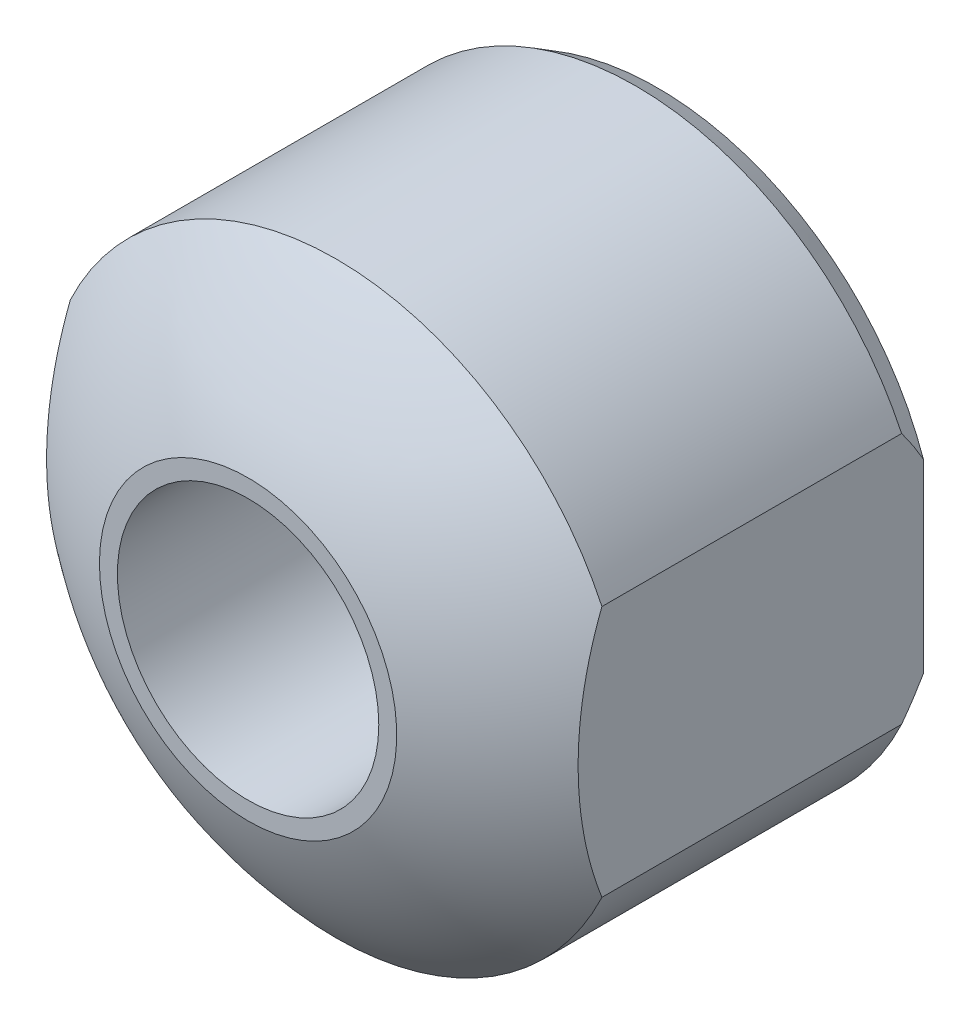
ISO-10303-21;
HEADER;
FILE_DESCRIPTION(('STEP AP214'),'2;1');
FILE_NAME('part.step','',(''),(''),'','','');
FILE_SCHEMA(('AUTOMOTIVE_DESIGN { 1 0 10303 214 1 1 1 1 }'));
ENDSEC;
DATA;
#1=APPLICATION_CONTEXT('core data for automotive mechanical design processes');
#2=APPLICATION_PROTOCOL_DEFINITION('international standard','automotive_design',2000,#1);
#3=PRODUCT_CONTEXT('',#1,'mechanical');
#4=PRODUCT('Part','Part','',(#3));
#5=PRODUCT_RELATED_PRODUCT_CATEGORY('part','',(#4));
#6=PRODUCT_DEFINITION_FORMATION('','',#4);
#7=PRODUCT_DEFINITION_CONTEXT('part definition',#1,'design');
#8=PRODUCT_DEFINITION('design','',#6,#7);
#9=PRODUCT_DEFINITION_SHAPE('','',#8);
#10=(LENGTH_UNIT() NAMED_UNIT(*) SI_UNIT(.MILLI.,.METRE.));
#11=(NAMED_UNIT(*) PLANE_ANGLE_UNIT() SI_UNIT($,.RADIAN.));
#12=(NAMED_UNIT(*) SI_UNIT($,.STERADIAN.) SOLID_ANGLE_UNIT());
#13=UNCERTAINTY_MEASURE_WITH_UNIT(LENGTH_MEASURE(1.E-05),#10,'distance_accuracy_value','');
#14=(GEOMETRIC_REPRESENTATION_CONTEXT(3) GLOBAL_UNCERTAINTY_ASSIGNED_CONTEXT((#13)) GLOBAL_UNIT_ASSIGNED_CONTEXT((#10,
#11,#12)) REPRESENTATION_CONTEXT('',''));
#15=CARTESIAN_POINT('',(0.,0.,0.));
#16=DIRECTION('',(0.,0.,1.));
#17=DIRECTION('',(1.,0.,0.));
#18=AXIS2_PLACEMENT_3D('',#15,#16,#17);
#19=CARTESIAN_POINT('',(-6.28837260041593E-13,0.,-1.20216336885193E-12));
#20=DIRECTION('',(0.,0.,1.));
#21=DIRECTION('',(1.,0.,0.));
#22=AXIS2_PLACEMENT_3D('',#19,#20,#21);
#23=SPHERICAL_SURFACE('',#22,10.0000000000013);
#24=CARTESIAN_POINT('',(0.,0.,9.4));
#25=DIRECTION('',(0.,0.,1.));
#26=DIRECTION('',(0.,-1.,0.));
#27=AXIS2_PLACEMENT_3D('',#24,#25,#26);
#28=CIRCLE('',#27,3.4117444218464);
#29=CARTESIAN_POINT('',(0.,-3.4117444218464,9.4));
#30=VERTEX_POINT('',#29);
#31=EDGE_CURVE('E9',#30,#30,#28,.T.);
#32=ORIENTED_EDGE('',*,*,#31,.F.);
#33=EDGE_LOOP('',(#32));
#34=FACE_BOUND('',#33,.T.);
#35=CARTESIAN_POINT('',(-6.1,0.,-1.20216336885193E-12));
#36=DIRECTION('',(1.,0.,0.));
#37=DIRECTION('',(0.,1.,0.));
#38=AXIS2_PLACEMENT_3D('',#35,#36,#37);
#39=CIRCLE('',#38,7.9240141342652);
#40=CARTESIAN_POINT('',(-6.1,-2.89006920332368,7.3781772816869));
#41=VERTEX_POINT('',#40);
#42=CARTESIAN_POINT('',(-6.1,2.89006920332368,7.3781772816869));
#43=VERTEX_POINT('',#42);
#44=EDGE_CURVE('E104',#41,#43,#39,.F.);
#45=ORIENTED_EDGE('',*,*,#44,.F.);
#46=CARTESIAN_POINT('',(0.,0.,7.3781772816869));
#47=DIRECTION('',(0.,0.,1.));
#48=DIRECTION('',(0.,-1.,0.));
#49=AXIS2_PLACEMENT_3D('',#46,#47,#48);
#50=CIRCLE('',#49,6.75);
#51=CARTESIAN_POINT('',(6.1,-2.89006920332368,7.3781772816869));
#52=VERTEX_POINT('',#51);
#53=EDGE_CURVE('E99',#41,#52,#50,.T.);
#54=ORIENTED_EDGE('',*,*,#53,.T.);
#55=CARTESIAN_POINT('',(6.1,0.,-1.20216336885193E-12));
#56=DIRECTION('',(-1.,0.,0.));
#57=DIRECTION('',(0.,-1.,0.));
#58=AXIS2_PLACEMENT_3D('',#55,#56,#57);
#59=CIRCLE('',#58,7.92401413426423);
#60=CARTESIAN_POINT('',(6.1,2.89006920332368,7.3781772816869));
#61=VERTEX_POINT('',#60);
#62=EDGE_CURVE('E92',#61,#52,#59,.F.);
#63=ORIENTED_EDGE('',*,*,#62,.F.);
#64=EDGE_CURVE('E22',#61,#43,#50,.T.);
#65=ORIENTED_EDGE('',*,*,#64,.T.);
#66=EDGE_LOOP('',(#45,#54,#63,#65));
#67=FACE_BOUND('',#66,.T.);
#68=ADVANCED_FACE('F14',(#34,#67),#23,.T.);
#69=CARTESIAN_POINT('',(0.,0.,0.));
#70=DIRECTION('',(0.,0.,1.));
#71=DIRECTION('',(0.,-1.,0.));
#72=AXIS2_PLACEMENT_3D('',#69,#70,#71);
#73=CYLINDRICAL_SURFACE('',#72,6.75);
#74=ORIENTED_EDGE('',*,*,#53,.F.);
#75=DIRECTION('',(0.,0.,1.));
#76=VECTOR('',#75,1.);
#77=CARTESIAN_POINT('',(-6.1,-2.89006920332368,0.));
#78=LINE('',#77,#76);
#79=CARTESIAN_POINT('',(-6.1,-2.89006920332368,0.5));
#80=VERTEX_POINT('',#79);
#81=EDGE_CURVE('E77',#41,#80,#78,.F.);
#82=ORIENTED_EDGE('',*,*,#81,.T.);
#83=CARTESIAN_POINT('',(0.,0.,0.5));
#84=DIRECTION('',(0.,0.,1.));
#85=DIRECTION('',(0.,-1.,0.));
#86=AXIS2_PLACEMENT_3D('',#83,#84,#85);
#87=CIRCLE('',#86,6.75);
#88=CARTESIAN_POINT('',(6.1,-2.89006920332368,0.5));
#89=VERTEX_POINT('',#88);
#90=EDGE_CURVE('E85',#80,#89,#87,.T.);
#91=ORIENTED_EDGE('',*,*,#90,.T.);
#92=DIRECTION('',(0.,0.,1.));
#93=VECTOR('',#92,1.);
#94=CARTESIAN_POINT('',(6.1,-2.89006920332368,0.));
#95=LINE('',#94,#93);
#96=EDGE_CURVE('E109',#89,#52,#95,.T.);
#97=ORIENTED_EDGE('',*,*,#96,.T.);
#98=EDGE_LOOP('',(#74,#82,#91,#97));
#99=FACE_BOUND('',#98,.T.);
#100=ADVANCED_FACE('F110',(#99),#73,.T.);
#101=CARTESIAN_POINT('',(0.,0.,0.5));
#102=DIRECTION('',(0.,0.,1.));
#103=DIRECTION('',(0.,-1.,0.));
#104=AXIS2_PLACEMENT_3D('',#101,#102,#103);
#105=CONICAL_SURFACE('',#104,6.75,0.523598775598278);
#106=ORIENTED_EDGE('',*,*,#90,.F.);
#107=CARTESIAN_POINT('',(-6.1,-6.7457549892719,4.56129591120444));
#108=CARTESIAN_POINT('',(-6.1,-6.59600104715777,4.36896022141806));
#109=CARTESIAN_POINT('',(-6.1,-6.44489016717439,4.1776631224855));
#110=CARTESIAN_POINT('',(-6.1,-6.13933110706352,3.79764621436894));
#111=CARTESIAN_POINT('',(-6.1,-5.98488178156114,3.60892732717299));
#112=CARTESIAN_POINT('',(-6.1,-5.66989753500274,3.23203536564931));
#113=CARTESIAN_POINT('',(-6.1,-5.5093072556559,3.04390839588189));
#114=CARTESIAN_POINT('',(-6.1,-5.18339599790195,2.67183463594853));
#115=CARTESIAN_POINT('',(-6.1,-5.01807573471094,2.48788722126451));
#116=CARTESIAN_POINT('',(-6.1,-4.66899691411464,2.11160286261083));
#117=CARTESIAN_POINT('',(-6.1,-4.48478858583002,1.9196809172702));
#118=CARTESIAN_POINT('',(-6.1,-4.10805487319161,1.54392645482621));
#119=CARTESIAN_POINT('',(-6.1,-3.91552558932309,1.36009781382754));
#120=CARTESIAN_POINT('',(-6.1,-3.52142274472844,1.0048343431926));
#121=CARTESIAN_POINT('',(-6.1,-3.31991213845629,0.833330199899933));
#122=CARTESIAN_POINT('',(-6.1,-2.90443359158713,0.506282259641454));
#123=CARTESIAN_POINT('',(-6.1,-2.69048143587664,0.350718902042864));
#124=CARTESIAN_POINT('',(-6.1,-2.3655731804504,0.139607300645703));
#125=CARTESIAN_POINT('',(-6.1,-2.26052343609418,0.0749563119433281));
#126=CARTESIAN_POINT('',(-6.1,-2.04683582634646,-0.0482684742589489));
#127=CARTESIAN_POINT('',(-6.1,-1.93819662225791,-0.106839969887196));
#128=CARTESIAN_POINT('',(-6.1,-1.71806811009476,-0.216271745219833));
#129=CARTESIAN_POINT('',(-6.1,-1.60660547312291,-0.267185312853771));
#130=CARTESIAN_POINT('',(-6.1,-1.38014316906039,-0.360455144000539));
#131=CARTESIAN_POINT('',(-6.1,-1.26514425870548,-0.402813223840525));
#132=CARTESIAN_POINT('',(-6.1,-1.04906853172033,-0.472062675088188));
#133=CARTESIAN_POINT('',(-6.1,-0.948428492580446,-0.500312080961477));
#134=CARTESIAN_POINT('',(-6.1,-0.745210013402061,-0.548709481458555));
#135=CARTESIAN_POINT('',(-6.1,-0.642631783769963,-0.568858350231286));
#136=CARTESIAN_POINT('',(-6.1,-0.436174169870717,-0.600353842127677));
#137=CARTESIAN_POINT('',(-6.1,-0.332295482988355,-0.611704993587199));
#138=CARTESIAN_POINT('',(-6.1,-0.1239350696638,-0.625190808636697));
#139=CARTESIAN_POINT('',(-6.1,-0.019453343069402,-0.62732546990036));
#140=CARTESIAN_POINT('',(-6.1,0.1893500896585,-0.622291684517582));
#141=CARTESIAN_POINT('',(-6.1,0.293671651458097,-0.615117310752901));
#142=CARTESIAN_POINT('',(-6.1,0.501288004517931,-0.591736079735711));
#143=CARTESIAN_POINT('',(-6.1,0.604582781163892,-0.575529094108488));
#144=CARTESIAN_POINT('',(-6.1,0.809582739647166,-0.534648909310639));
#145=CARTESIAN_POINT('',(-6.1,0.911286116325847,-0.50996673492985));
#146=CARTESIAN_POINT('',(-6.1,1.11255204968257,-0.452920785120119));
#147=CARTESIAN_POINT('',(-6.1,1.21211335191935,-0.420552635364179));
#148=CARTESIAN_POINT('',(-6.1,1.46085038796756,-0.330063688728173));
#149=CARTESIAN_POINT('',(-6.1,1.60837216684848,-0.267383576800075));
#150=CARTESIAN_POINT('',(-6.1,1.89722848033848,-0.129222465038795));
#151=CARTESIAN_POINT('',(-6.1,2.0385610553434,-0.053737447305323));
#152=CARTESIAN_POINT('',(-6.1,2.31593692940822,0.107739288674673));
#153=CARTESIAN_POINT('',(-6.1,2.45195190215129,0.193779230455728));
#154=CARTESIAN_POINT('',(-6.1,2.71844663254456,0.373895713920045));
#155=CARTESIAN_POINT('',(-6.1,2.84892774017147,0.467970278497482));
#156=CARTESIAN_POINT('',(-6.1,3.16836896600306,0.710619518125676));
#157=CARTESIAN_POINT('',(-6.1,3.35433189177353,0.863135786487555));
#158=CARTESIAN_POINT('',(-6.1,3.62543350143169,1.09862756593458));
#159=CARTESIAN_POINT('',(-6.1,3.71398904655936,1.17775366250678));
#160=CARTESIAN_POINT('',(-6.1,3.88909023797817,1.33816368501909));
#161=CARTESIAN_POINT('',(-6.1,3.97563631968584,1.4194471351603));
#162=CARTESIAN_POINT('',(-6.1,4.06129591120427,1.50166195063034));
#163=B_SPLINE_CURVE_WITH_KNOTS('',3,(#107,#108,#109,#110,#111,#112,#113,#114,#115,#116,#117,
#118,#119,#120,#121,#122,#123,#124,#125,#126,#127,#128,#129,#130,#131,#132,#133,#134,#135,#136,
#137,#138,#139,#140,#141,#142,#143,#144,#145,#146,#147,#148,#149,#150,#151,#152,#153,#154,#155,
#156,#157,#158,#159,#160,#161,#162),.UNSPECIFIED.,.F.,.F.,(4,2,2,2,2,2,2,2,2,2,2,2,2,2,2,2,2,2,
2,2,2,2,2,2,2,2,2,4),(0.,0.731297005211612,1.46284902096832,2.20482627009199,2.94669191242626,
3.74456312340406,4.54281238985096,5.33614891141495,6.12849998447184,6.49838988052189,
6.86841932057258,7.23574121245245,7.60298503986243,7.91627517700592,8.22953149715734,
8.54262647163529,8.85572152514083,9.16901602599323,9.48231497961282,9.79594674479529,
10.1097574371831,10.5897914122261,11.0699762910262,11.552443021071,12.0347913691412,
12.7557189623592,13.1119644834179,13.4681320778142),.UNSPECIFIED.);
#164=CARTESIAN_POINT('',(-6.1,-2.1304269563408,0.));
#165=VERTEX_POINT('',#164);
#166=EDGE_CURVE('E69',#80,#165,#163,.T.);
#167=ORIENTED_EDGE('',*,*,#166,.T.);
#168=CARTESIAN_POINT('',(0.,0.,0.));
#169=DIRECTION('',(0.,0.,1.));
#170=DIRECTION('',(0.,-1.,0.));
#171=AXIS2_PLACEMENT_3D('',#168,#169,#170);
#172=CIRCLE('',#171,6.4613248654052);
#173=CARTESIAN_POINT('',(6.1,-2.13042695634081,0.));
#174=VERTEX_POINT('',#173);
#175=EDGE_CURVE('E83',#165,#174,#172,.T.);
#176=ORIENTED_EDGE('',*,*,#175,.T.);
#177=CARTESIAN_POINT('',(6.1,4.06129591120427,1.50166195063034));
#178=CARTESIAN_POINT('',(6.1,3.98103320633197,1.42462646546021));
#179=CARTESIAN_POINT('',(6.1,3.8999893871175,1.34840677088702));
#180=CARTESIAN_POINT('',(6.1,3.73614515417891,1.19783935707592));
#181=CARTESIAN_POINT('',(6.1,3.6533443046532,1.1234921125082));
#182=CARTESIAN_POINT('',(6.1,3.40121673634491,0.902926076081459));
#183=CARTESIAN_POINT('',(6.1,3.22898446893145,0.759978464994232));
#184=CARTESIAN_POINT('',(6.1,2.87012551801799,0.481843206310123));
#185=CARTESIAN_POINT('',(6.1,2.68322481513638,0.347006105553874));
#186=CARTESIAN_POINT('',(6.1,2.29820293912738,0.0949408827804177));
#187=CARTESIAN_POINT('',(6.1,2.10010825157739,-0.0223265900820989));
#188=CARTESIAN_POINT('',(6.1,1.79529398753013,-0.178998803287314));
#189=CARTESIAN_POINT('',(6.1,1.69332576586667,-0.227676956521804));
#190=CARTESIAN_POINT('',(6.1,1.48631987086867,-0.318103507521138));
#191=CARTESIAN_POINT('',(6.1,1.38128192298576,-0.359851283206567));
#192=CARTESIAN_POINT('',(6.1,1.16906940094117,-0.435040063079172));
#193=CARTESIAN_POINT('',(6.1,1.06191464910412,-0.468536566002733));
#194=CARTESIAN_POINT('',(6.1,0.845197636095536,-0.526507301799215));
#195=CARTESIAN_POINT('',(6.1,0.735636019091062,-0.550983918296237));
#196=CARTESIAN_POINT('',(6.1,0.513197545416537,-0.590262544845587));
#197=CARTESIAN_POINT('',(6.1,0.400295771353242,-0.60492519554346));
#198=CARTESIAN_POINT('',(6.1,0.173603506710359,-0.623373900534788));
#199=CARTESIAN_POINT('',(6.1,0.0598130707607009,-0.627160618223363));
#200=CARTESIAN_POINT('',(6.1,-0.167693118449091,-0.623679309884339));
#201=CARTESIAN_POINT('',(6.1,-0.281408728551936,-0.616401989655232));
#202=CARTESIAN_POINT('',(6.1,-0.507636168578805,-0.591115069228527));
#203=CARTESIAN_POINT('',(6.1,-0.6201478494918,-0.573104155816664));
#204=CARTESIAN_POINT('',(6.1,-0.856714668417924,-0.524309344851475));
#205=CARTESIAN_POINT('',(6.1,-0.980502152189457,-0.49223451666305));
#206=CARTESIAN_POINT('',(6.1,-1.22467848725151,-0.417015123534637));
#207=CARTESIAN_POINT('',(6.1,-1.34506576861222,-0.373865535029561));
#208=CARTESIAN_POINT('',(6.1,-1.58228365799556,-0.278009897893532));
#209=CARTESIAN_POINT('',(6.1,-1.69910467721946,-0.225280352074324));
#210=CARTESIAN_POINT('',(6.1,-1.92878819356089,-0.111888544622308));
#211=CARTESIAN_POINT('',(6.1,-2.04165083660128,-0.051226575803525));
#212=CARTESIAN_POINT('',(6.1,-2.28375593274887,0.0883162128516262));
#213=CARTESIAN_POINT('',(6.1,-2.41224172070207,0.168503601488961));
#214=CARTESIAN_POINT('',(6.1,-2.66433323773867,0.336248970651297));
#215=CARTESIAN_POINT('',(6.1,-2.78793706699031,0.42380977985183));
#216=CARTESIAN_POINT('',(6.1,-3.03089935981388,0.604966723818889));
#217=CARTESIAN_POINT('',(6.1,-3.15025130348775,0.698571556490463));
#218=CARTESIAN_POINT('',(6.1,-3.38503074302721,0.890595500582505));
#219=CARTESIAN_POINT('',(6.1,-3.50045750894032,0.989015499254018));
#220=CARTESIAN_POINT('',(6.1,-3.84308154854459,1.29148463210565));
#221=CARTESIAN_POINT('',(6.1,-4.06500787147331,1.50150434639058));
#222=CARTESIAN_POINT('',(6.1,-4.49777928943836,1.9321606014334));
#223=CARTESIAN_POINT('',(6.1,-4.70863322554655,2.15278839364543));
#224=CARTESIAN_POINT('',(6.1,-5.07745656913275,2.55361929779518));
#225=CARTESIAN_POINT('',(6.1,-5.2370588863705,2.7323288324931));
#226=CARTESIAN_POINT('',(6.1,-5.55190643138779,3.09358887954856));
#227=CARTESIAN_POINT('',(6.1,-5.70715092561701,3.27614002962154));
#228=CARTESIAN_POINT('',(6.1,-6.01132961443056,3.6411459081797));
#229=CARTESIAN_POINT('',(6.1,-6.16032635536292,3.82354868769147));
#230=CARTESIAN_POINT('',(6.1,-6.45522258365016,4.19074263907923));
#231=CARTESIAN_POINT('',(6.1,-6.60112309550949,4.3755329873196));
#232=CARTESIAN_POINT('',(6.1,-6.74575498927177,4.56129591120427));
#233=B_SPLINE_CURVE_WITH_KNOTS('',3,(#177,#178,#179,#180,#181,#182,#183,#184,#185,#186,#187,
#188,#189,#190,#191,#192,#193,#194,#195,#196,#197,#198,#199,#200,#201,#202,#203,#204,#205,#206,
#207,#208,#209,#210,#211,#212,#213,#214,#215,#216,#217,#218,#219,#220,#221,#222,#223,#224,#225,
#226,#227,#228,#229,#230,#231,#232),.UNSPECIFIED.,.F.,.F.,(4,2,2,2,2,2,2,2,2,2,2,2,2,2,2,2,2,2,
2,2,2,2,2,2,2,2,2,4),(0.,0.333737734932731,0.667559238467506,1.33862492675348,2.02937199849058,
2.71854809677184,3.05731690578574,3.39611610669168,3.7325701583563,4.06893523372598,
4.40998075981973,4.75100548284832,5.0923168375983,5.43366995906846,5.81669672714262,
6.19989754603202,6.58405126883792,6.96819081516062,7.42223331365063,7.87645079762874,
8.33133717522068,8.78630768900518,9.7023388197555,10.6176270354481,11.336357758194,
12.0552087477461,12.7617419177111,13.46803753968),.UNSPECIFIED.);
#234=EDGE_CURVE('E111',#174,#89,#233,.T.);
#235=ORIENTED_EDGE('',*,*,#234,.T.);
#236=EDGE_LOOP('',(#106,#167,#176,#235));
#237=FACE_BOUND('',#236,.T.);
#238=ADVANCED_FACE('F81',(#237),#105,.T.);
#239=CARTESIAN_POINT('',(6.4613248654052,0.,0.));
#240=DIRECTION('',(0.,0.,-1.));
#241=DIRECTION('',(0.,1.,0.));
#242=AXIS2_PLACEMENT_3D('',#239,#240,#241);
#243=PLANE('',#242);
#244=CARTESIAN_POINT('',(0.,0.,0.));
#245=DIRECTION('',(0.,0.,1.));
#246=DIRECTION('',(1.,0.,0.));
#247=AXIS2_PLACEMENT_3D('',#244,#245,#246);
#248=CIRCLE('',#247,3.);
#249=CARTESIAN_POINT('',(3.,0.,0.));
#250=VERTEX_POINT('',#249);
#251=EDGE_CURVE('E165',#250,#250,#248,.T.);
#252=ORIENTED_EDGE('',*,*,#251,.T.);
#253=EDGE_LOOP('',(#252));
#254=FACE_BOUND('',#253,.T.);
#255=ORIENTED_EDGE('',*,*,#175,.F.);
#256=DIRECTION('',(0.,-1.,0.));
#257=VECTOR('',#256,1.);
#258=CARTESIAN_POINT('',(-6.1,6.75,0.));
#259=LINE('',#258,#257);
#260=CARTESIAN_POINT('',(-6.1,2.1304269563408,0.));
#261=VERTEX_POINT('',#260);
#262=EDGE_CURVE('E65',#261,#165,#259,.T.);
#263=ORIENTED_EDGE('',*,*,#262,.F.);
#264=CARTESIAN_POINT('',(6.1,2.13042695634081,0.));
#265=VERTEX_POINT('',#264);
#266=EDGE_CURVE('E91',#265,#261,#172,.T.);
#267=ORIENTED_EDGE('',*,*,#266,.F.);
#268=DIRECTION('',(0.,-1.,0.));
#269=VECTOR('',#268,1.);
#270=CARTESIAN_POINT('',(6.1,6.75,0.));
#271=LINE('',#270,#269);
#272=EDGE_CURVE('E89',#265,#174,#271,.T.);
#273=ORIENTED_EDGE('',*,*,#272,.T.);
#274=EDGE_LOOP('',(#255,#263,#267,#273));
#275=FACE_BOUND('',#274,.T.);
#276=ADVANCED_FACE('F88',(#254,#275),#243,.T.);
#277=DIRECTION('',(0.,0.,1.));
#278=VECTOR('',#277,1.);
#279=CARTESIAN_POINT('',(-6.1,2.89006920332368,0.));
#280=LINE('',#279,#278);
#281=CARTESIAN_POINT('',(-6.1,2.89006920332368,0.5));
#282=VERTEX_POINT('',#281);
#283=EDGE_CURVE('E185',#43,#282,#280,.F.);
#284=ORIENTED_EDGE('',*,*,#283,.F.);
#285=ORIENTED_EDGE('',*,*,#64,.F.);
#286=DIRECTION('',(0.,0.,1.));
#287=VECTOR('',#286,1.);
#288=CARTESIAN_POINT('',(6.1,2.89006920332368,0.));
#289=LINE('',#288,#287);
#290=CARTESIAN_POINT('',(6.1,2.89006920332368,0.5));
#291=VERTEX_POINT('',#290);
#292=EDGE_CURVE('E29',#291,#61,#289,.T.);
#293=ORIENTED_EDGE('',*,*,#292,.F.);
#294=EDGE_CURVE('E97',#291,#282,#87,.T.);
#295=ORIENTED_EDGE('',*,*,#294,.T.);
#296=EDGE_LOOP('',(#284,#285,#293,#295));
#297=FACE_BOUND('',#296,.T.);
#298=ADVANCED_FACE('F136',(#297),#73,.T.);
#299=CARTESIAN_POINT('',(-6.1,6.7457549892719,4.56129591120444));
#300=CARTESIAN_POINT('',(-6.1,6.59600104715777,4.36896022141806));
#301=CARTESIAN_POINT('',(-6.1,6.44489016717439,4.1776631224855));
#302=CARTESIAN_POINT('',(-6.1,6.13933110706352,3.79764621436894));
#303=CARTESIAN_POINT('',(-6.1,5.98488178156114,3.60892732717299));
#304=CARTESIAN_POINT('',(-6.1,5.66989753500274,3.23203536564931));
#305=CARTESIAN_POINT('',(-6.1,5.5093072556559,3.04390839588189));
#306=CARTESIAN_POINT('',(-6.1,5.18339599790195,2.67183463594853));
#307=CARTESIAN_POINT('',(-6.1,5.01807573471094,2.48788722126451));
#308=CARTESIAN_POINT('',(-6.1,4.66899691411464,2.11160286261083));
#309=CARTESIAN_POINT('',(-6.1,4.48478858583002,1.9196809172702));
#310=CARTESIAN_POINT('',(-6.1,4.10805487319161,1.54392645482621));
#311=CARTESIAN_POINT('',(-6.1,3.91552558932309,1.36009781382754));
#312=CARTESIAN_POINT('',(-6.1,3.52142274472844,1.0048343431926));
#313=CARTESIAN_POINT('',(-6.1,3.31991213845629,0.833330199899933));
#314=CARTESIAN_POINT('',(-6.1,2.90443359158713,0.506282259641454));
#315=CARTESIAN_POINT('',(-6.1,2.69048143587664,0.350718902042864));
#316=CARTESIAN_POINT('',(-6.1,2.3655731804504,0.139607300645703));
#317=CARTESIAN_POINT('',(-6.1,2.26052343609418,0.0749563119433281));
#318=CARTESIAN_POINT('',(-6.1,2.04683582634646,-0.0482684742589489));
#319=CARTESIAN_POINT('',(-6.1,1.93819662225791,-0.106839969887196));
#320=CARTESIAN_POINT('',(-6.1,1.71806811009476,-0.216271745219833));
#321=CARTESIAN_POINT('',(-6.1,1.60660547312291,-0.267185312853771));
#322=CARTESIAN_POINT('',(-6.1,1.38014316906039,-0.360455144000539));
#323=CARTESIAN_POINT('',(-6.1,1.26514425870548,-0.402813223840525));
#324=CARTESIAN_POINT('',(-6.1,1.04906853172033,-0.472062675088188));
#325=CARTESIAN_POINT('',(-6.1,0.948428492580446,-0.500312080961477));
#326=CARTESIAN_POINT('',(-6.1,0.745210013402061,-0.548709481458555));
#327=CARTESIAN_POINT('',(-6.1,0.642631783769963,-0.568858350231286));
#328=CARTESIAN_POINT('',(-6.1,0.436174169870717,-0.600353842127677));
#329=CARTESIAN_POINT('',(-6.1,0.332295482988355,-0.611704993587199));
#330=CARTESIAN_POINT('',(-6.1,0.1239350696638,-0.625190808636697));
#331=CARTESIAN_POINT('',(-6.1,0.019453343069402,-0.62732546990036));
#332=CARTESIAN_POINT('',(-6.1,-0.1893500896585,-0.622291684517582));
#333=CARTESIAN_POINT('',(-6.1,-0.293671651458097,-0.615117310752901));
#334=CARTESIAN_POINT('',(-6.1,-0.501288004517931,-0.591736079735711));
#335=CARTESIAN_POINT('',(-6.1,-0.604582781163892,-0.575529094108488));
#336=CARTESIAN_POINT('',(-6.1,-0.809582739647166,-0.534648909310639));
#337=CARTESIAN_POINT('',(-6.1,-0.911286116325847,-0.50996673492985));
#338=CARTESIAN_POINT('',(-6.1,-1.11255204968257,-0.452920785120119));
#339=CARTESIAN_POINT('',(-6.1,-1.21211335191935,-0.420552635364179));
#340=CARTESIAN_POINT('',(-6.1,-1.46085038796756,-0.330063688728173));
#341=CARTESIAN_POINT('',(-6.1,-1.60837216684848,-0.267383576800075));
#342=CARTESIAN_POINT('',(-6.1,-1.89722848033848,-0.129222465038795));
#343=CARTESIAN_POINT('',(-6.1,-2.0385610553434,-0.053737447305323));
#344=CARTESIAN_POINT('',(-6.1,-2.31593692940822,0.107739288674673));
#345=CARTESIAN_POINT('',(-6.1,-2.45195190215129,0.193779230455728));
#346=CARTESIAN_POINT('',(-6.1,-2.71844663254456,0.373895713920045));
#347=CARTESIAN_POINT('',(-6.1,-2.84892774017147,0.467970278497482));
#348=CARTESIAN_POINT('',(-6.1,-3.16836896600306,0.710619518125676));
#349=CARTESIAN_POINT('',(-6.1,-3.35433189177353,0.863135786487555));
#350=CARTESIAN_POINT('',(-6.1,-3.62543350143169,1.09862756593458));
#351=CARTESIAN_POINT('',(-6.1,-3.71398904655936,1.17775366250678));
#352=CARTESIAN_POINT('',(-6.1,-3.88909023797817,1.33816368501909));
#353=CARTESIAN_POINT('',(-6.1,-3.97563631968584,1.4194471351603));
#354=CARTESIAN_POINT('',(-6.1,-4.06129591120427,1.50166195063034));
#355=B_SPLINE_CURVE_WITH_KNOTS('',3,(#299,#300,#301,#302,#303,#304,#305,#306,#307,#308,#309,
#310,#311,#312,#313,#314,#315,#316,#317,#318,#319,#320,#321,#322,#323,#324,#325,#326,#327,#328,
#329,#330,#331,#332,#333,#334,#335,#336,#337,#338,#339,#340,#341,#342,#343,#344,#345,#346,#347,
#348,#349,#350,#351,#352,#353,#354),.UNSPECIFIED.,.F.,.F.,(4,2,2,2,2,2,2,2,2,2,2,2,2,2,2,2,2,2,
2,2,2,2,2,2,2,2,2,4),(0.,0.731297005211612,1.46284902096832,2.20482627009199,2.94669191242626,
3.74456312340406,4.54281238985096,5.33614891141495,6.12849998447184,6.49838988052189,
6.86841932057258,7.23574121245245,7.60298503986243,7.91627517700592,8.22953149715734,
8.54262647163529,8.85572152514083,9.16901602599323,9.48231497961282,9.79594674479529,
10.1097574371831,10.5897914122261,11.0699762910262,11.552443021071,12.0347913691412,
12.7557189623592,13.1119644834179,13.4681320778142),.UNSPECIFIED.);
#356=EDGE_CURVE('E72',#282,#261,#355,.T.);
#357=ORIENTED_EDGE('',*,*,#356,.F.);
#358=ORIENTED_EDGE('',*,*,#294,.F.);
#359=CARTESIAN_POINT('',(6.1,-4.06129591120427,1.50166195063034));
#360=CARTESIAN_POINT('',(6.1,-3.98103320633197,1.42462646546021));
#361=CARTESIAN_POINT('',(6.1,-3.8999893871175,1.34840677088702));
#362=CARTESIAN_POINT('',(6.1,-3.73614515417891,1.19783935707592));
#363=CARTESIAN_POINT('',(6.1,-3.6533443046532,1.1234921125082));
#364=CARTESIAN_POINT('',(6.1,-3.40121673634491,0.902926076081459));
#365=CARTESIAN_POINT('',(6.1,-3.22898446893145,0.759978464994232));
#366=CARTESIAN_POINT('',(6.1,-2.87012551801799,0.481843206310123));
#367=CARTESIAN_POINT('',(6.1,-2.68322481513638,0.347006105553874));
#368=CARTESIAN_POINT('',(6.1,-2.29820293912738,0.0949408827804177));
#369=CARTESIAN_POINT('',(6.1,-2.10010825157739,-0.0223265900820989));
#370=CARTESIAN_POINT('',(6.1,-1.79529398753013,-0.178998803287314));
#371=CARTESIAN_POINT('',(6.1,-1.69332576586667,-0.227676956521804));
#372=CARTESIAN_POINT('',(6.1,-1.48631987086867,-0.318103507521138));
#373=CARTESIAN_POINT('',(6.1,-1.38128192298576,-0.359851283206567));
#374=CARTESIAN_POINT('',(6.1,-1.16906940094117,-0.435040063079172));
#375=CARTESIAN_POINT('',(6.1,-1.06191464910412,-0.468536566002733));
#376=CARTESIAN_POINT('',(6.1,-0.845197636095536,-0.526507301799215));
#377=CARTESIAN_POINT('',(6.1,-0.735636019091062,-0.550983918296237));
#378=CARTESIAN_POINT('',(6.1,-0.513197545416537,-0.590262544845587));
#379=CARTESIAN_POINT('',(6.1,-0.400295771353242,-0.60492519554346));
#380=CARTESIAN_POINT('',(6.1,-0.173603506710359,-0.623373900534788));
#381=CARTESIAN_POINT('',(6.1,-0.0598130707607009,-0.627160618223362));
#382=CARTESIAN_POINT('',(6.1,0.167693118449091,-0.623679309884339));
#383=CARTESIAN_POINT('',(6.1,0.281408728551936,-0.616401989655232));
#384=CARTESIAN_POINT('',(6.1,0.507636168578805,-0.591115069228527));
#385=CARTESIAN_POINT('',(6.1,0.6201478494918,-0.573104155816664));
#386=CARTESIAN_POINT('',(6.1,0.856714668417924,-0.524309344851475));
#387=CARTESIAN_POINT('',(6.1,0.980502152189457,-0.49223451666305));
#388=CARTESIAN_POINT('',(6.1,1.22467848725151,-0.417015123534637));
#389=CARTESIAN_POINT('',(6.1,1.34506576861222,-0.373865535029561));
#390=CARTESIAN_POINT('',(6.1,1.58228365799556,-0.278009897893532));
#391=CARTESIAN_POINT('',(6.1,1.69910467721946,-0.225280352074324));
#392=CARTESIAN_POINT('',(6.1,1.92878819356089,-0.111888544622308));
#393=CARTESIAN_POINT('',(6.1,2.04165083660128,-0.0512265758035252));
#394=CARTESIAN_POINT('',(6.1,2.28375593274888,0.0883162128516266));
#395=CARTESIAN_POINT('',(6.1,2.41224172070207,0.168503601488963));
#396=CARTESIAN_POINT('',(6.1,2.66433323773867,0.336248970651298));
#397=CARTESIAN_POINT('',(6.1,2.78793706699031,0.42380977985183));
#398=CARTESIAN_POINT('',(6.1,3.03089935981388,0.604966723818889));
#399=CARTESIAN_POINT('',(6.1,3.15025130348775,0.698571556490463));
#400=CARTESIAN_POINT('',(6.1,3.38503074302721,0.890595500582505));
#401=CARTESIAN_POINT('',(6.1,3.50045750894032,0.989015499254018));
#402=CARTESIAN_POINT('',(6.1,3.84308154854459,1.29148463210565));
#403=CARTESIAN_POINT('',(6.1,4.06500787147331,1.50150434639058));
#404=CARTESIAN_POINT('',(6.1,4.49777928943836,1.9321606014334));
#405=CARTESIAN_POINT('',(6.1,4.70863322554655,2.15278839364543));
#406=CARTESIAN_POINT('',(6.1,5.07745656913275,2.55361929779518));
#407=CARTESIAN_POINT('',(6.1,5.23705888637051,2.7323288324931));
#408=CARTESIAN_POINT('',(6.1,5.5519064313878,3.09358887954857));
#409=CARTESIAN_POINT('',(6.1,5.70715092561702,3.27614002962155));
#410=CARTESIAN_POINT('',(6.1,6.01132961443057,3.64114590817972));
#411=CARTESIAN_POINT('',(6.1,6.16032635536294,3.8235486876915));
#412=CARTESIAN_POINT('',(6.1,6.45522258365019,4.19074263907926));
#413=CARTESIAN_POINT('',(6.1,6.60112309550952,4.37553298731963));
#414=CARTESIAN_POINT('',(6.1,6.7457549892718,4.5612959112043));
#415=B_SPLINE_CURVE_WITH_KNOTS('',3,(#359,#360,#361,#362,#363,#364,#365,#366,#367,#368,#369,
#370,#371,#372,#373,#374,#375,#376,#377,#378,#379,#380,#381,#382,#383,#384,#385,#386,#387,#388,
#389,#390,#391,#392,#393,#394,#395,#396,#397,#398,#399,#400,#401,#402,#403,#404,#405,#406,#407,
#408,#409,#410,#411,#412,#413,#414),.UNSPECIFIED.,.F.,.F.,(4,2,2,2,2,2,2,2,2,2,2,2,2,2,2,2,2,2,
2,2,2,2,2,2,2,2,2,4),(0.,0.333737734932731,0.667559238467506,1.33862492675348,2.02937199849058,
2.71854809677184,3.05731690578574,3.39611610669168,3.7325701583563,4.06893523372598,
4.40998075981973,4.75100548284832,5.0923168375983,5.43366995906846,5.81669672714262,
6.19989754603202,6.58405126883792,6.96819081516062,7.42223331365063,7.87645079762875,
8.33133717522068,8.78630768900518,9.7023388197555,10.6176270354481,11.336357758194,
12.0552087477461,12.7617419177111,13.4680375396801),.UNSPECIFIED.);
#416=EDGE_CURVE('E34',#265,#291,#415,.T.);
#417=ORIENTED_EDGE('',*,*,#416,.F.);
#418=ORIENTED_EDGE('',*,*,#266,.T.);
#419=EDGE_LOOP('',(#357,#358,#417,#418));
#420=FACE_BOUND('',#419,.T.);
#421=ADVANCED_FACE('F144',(#420),#105,.T.);
#422=CARTESIAN_POINT('',(0.,0.,9.4));
#423=DIRECTION('',(0.,0.,1.));
#424=DIRECTION('',(0.,-1.,0.));
#425=AXIS2_PLACEMENT_3D('',#422,#423,#424);
#426=PLANE('',#425);
#427=CARTESIAN_POINT('',(0.,0.,9.4));
#428=DIRECTION('',(0.,0.,1.));
#429=DIRECTION('',(1.,0.,0.));
#430=AXIS2_PLACEMENT_3D('',#427,#428,#429);
#431=CIRCLE('',#430,3.);
#432=CARTESIAN_POINT('',(3.,0.,9.4));
#433=VERTEX_POINT('',#432);
#434=EDGE_CURVE('E86',#433,#433,#431,.T.);
#435=ORIENTED_EDGE('',*,*,#434,.F.);
#436=EDGE_LOOP('',(#435));
#437=FACE_BOUND('',#436,.T.);
#438=ORIENTED_EDGE('',*,*,#31,.T.);
#439=EDGE_LOOP('',(#438));
#440=FACE_BOUND('',#439,.T.);
#441=ADVANCED_FACE('F16',(#437,#440),#426,.T.);
#442=CARTESIAN_POINT('',(6.1,6.75,9.4));
#443=DIRECTION('',(-1.,0.,0.));
#444=DIRECTION('',(0.,-1.,0.));
#445=AXIS2_PLACEMENT_3D('',#442,#443,#444);
#446=PLANE('',#445);
#447=ORIENTED_EDGE('',*,*,#62,.T.);
#448=ORIENTED_EDGE('',*,*,#96,.F.);
#449=ORIENTED_EDGE('',*,*,#234,.F.);
#450=ORIENTED_EDGE('',*,*,#272,.F.);
#451=ORIENTED_EDGE('',*,*,#416,.T.);
#452=ORIENTED_EDGE('',*,*,#292,.T.);
#453=EDGE_LOOP('',(#447,#448,#449,#450,#451,#452));
#454=FACE_BOUND('',#453,.T.);
#455=ADVANCED_FACE('F108',(#454),#446,.F.);
#456=CARTESIAN_POINT('',(-6.1,6.75,0.));
#457=DIRECTION('',(1.,0.,0.));
#458=DIRECTION('',(0.,1.,0.));
#459=AXIS2_PLACEMENT_3D('',#456,#457,#458);
#460=PLANE('',#459);
#461=ORIENTED_EDGE('',*,*,#44,.T.);
#462=ORIENTED_EDGE('',*,*,#283,.T.);
#463=ORIENTED_EDGE('',*,*,#356,.T.);
#464=ORIENTED_EDGE('',*,*,#262,.T.);
#465=ORIENTED_EDGE('',*,*,#166,.F.);
#466=ORIENTED_EDGE('',*,*,#81,.F.);
#467=EDGE_LOOP('',(#461,#462,#463,#464,#465,#466));
#468=FACE_BOUND('',#467,.T.);
#469=ADVANCED_FACE('F67',(#468),#460,.F.);
#470=CARTESIAN_POINT('',(0.,0.,9.4));
#471=DIRECTION('',(0.,0.,-1.));
#472=DIRECTION('',(-1.,0.,0.));
#473=AXIS2_PLACEMENT_3D('',#470,#471,#472);
#474=CYLINDRICAL_SURFACE('',#473,3.);
#475=ORIENTED_EDGE('',*,*,#434,.T.);
#476=EDGE_LOOP('',(#475));
#477=FACE_BOUND('',#476,.T.);
#478=ORIENTED_EDGE('',*,*,#251,.F.);
#479=EDGE_LOOP('',(#478));
#480=FACE_BOUND('',#479,.T.);
#481=ADVANCED_FACE('F176',(#477,#480),#474,.F.);
#482=CLOSED_SHELL('',(#68,#100,#238,#276,#298,#421,#441,#455,#469,#481));
#483=MANIFOLD_SOLID_BREP('B1',#482);
#484=ADVANCED_BREP_SHAPE_REPRESENTATION('',(#18,#483),#14);
#485=SHAPE_DEFINITION_REPRESENTATION(#9,#484);
ENDSEC;
END-ISO-10303-21;
